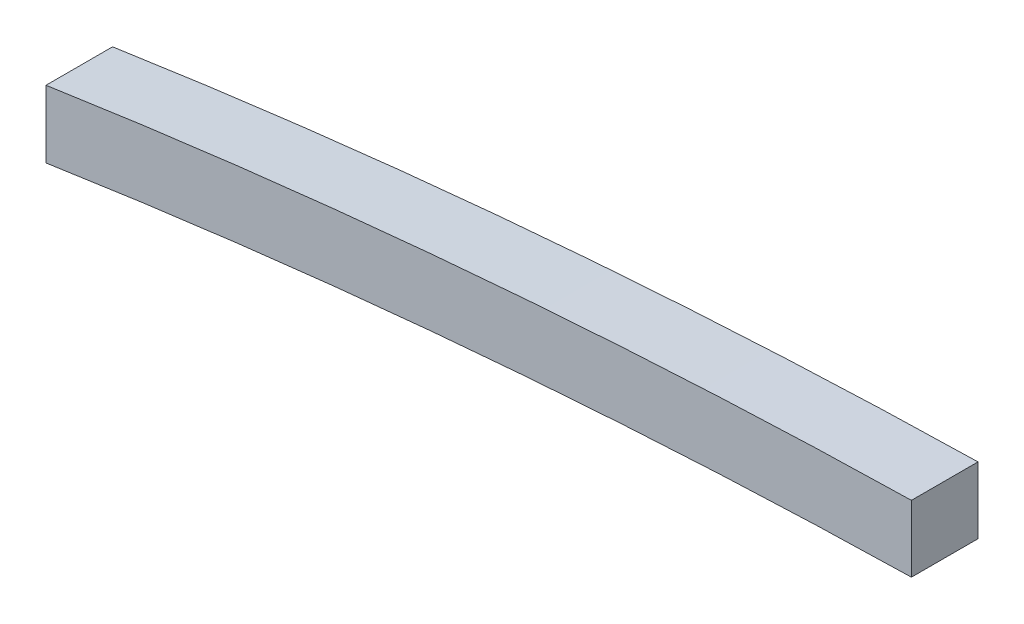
ISO-10303-21;
HEADER;
FILE_DESCRIPTION(('STEP AP214'),'2;1');
FILE_NAME('part.step','',(''),(''),'','','');
FILE_SCHEMA(('AUTOMOTIVE_DESIGN { 1 0 10303 214 1 1 1 1 }'));
ENDSEC;
DATA;
#1=APPLICATION_CONTEXT('core data for automotive mechanical design processes');
#2=APPLICATION_PROTOCOL_DEFINITION('international standard','automotive_design',2000,#1);
#3=PRODUCT_CONTEXT('',#1,'mechanical');
#4=PRODUCT('Part','Part','',(#3));
#5=PRODUCT_RELATED_PRODUCT_CATEGORY('part','',(#4));
#6=PRODUCT_DEFINITION_FORMATION('','',#4);
#7=PRODUCT_DEFINITION_CONTEXT('part definition',#1,'design');
#8=PRODUCT_DEFINITION('design','',#6,#7);
#9=PRODUCT_DEFINITION_SHAPE('','',#8);
#10=(LENGTH_UNIT() NAMED_UNIT(*) SI_UNIT(.MILLI.,.METRE.));
#11=(NAMED_UNIT(*) PLANE_ANGLE_UNIT() SI_UNIT($,.RADIAN.));
#12=(NAMED_UNIT(*) SI_UNIT($,.STERADIAN.) SOLID_ANGLE_UNIT());
#13=UNCERTAINTY_MEASURE_WITH_UNIT(LENGTH_MEASURE(1.E-05),#10,'distance_accuracy_value','');
#14=(GEOMETRIC_REPRESENTATION_CONTEXT(3) GLOBAL_UNCERTAINTY_ASSIGNED_CONTEXT((#13)) GLOBAL_UNIT_ASSIGNED_CONTEXT((#10,
#11,#12)) REPRESENTATION_CONTEXT('',''));
#15=CARTESIAN_POINT('',(0.,0.,0.));
#16=DIRECTION('',(0.,0.,1.));
#17=DIRECTION('',(1.,0.,0.));
#18=AXIS2_PLACEMENT_3D('',#15,#16,#17);
#19=CARTESIAN_POINT('',(650.,-1116.52349681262,-50.));
#20=DIRECTION('',(-1.,0.,0.));
#21=DIRECTION('',(0.,0.,1.));
#22=AXIS2_PLACEMENT_3D('',#19,#20,#21);
#23=PLANE('',#22);
#24=DIRECTION('',(0.,-1.,0.));
#25=VECTOR('',#24,1.);
#26=CARTESIAN_POINT('',(650.,-1116.52349681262,0.));
#27=LINE('',#26,#25);
#28=CARTESIAN_POINT('',(650.,105.579820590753,0.));
#29=VERTEX_POINT('',#28);
#30=CARTESIAN_POINT('',(650.,55.5699166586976,0.));
#31=VERTEX_POINT('',#30);
#32=EDGE_CURVE('E97',#29,#31,#27,.T.);
#33=ORIENTED_EDGE('',*,*,#32,.T.);
#34=DIRECTION('',(0.,0.,1.));
#35=VECTOR('',#34,1.);
#36=CARTESIAN_POINT('',(650.,55.5699166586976,-50.));
#37=LINE('',#36,#35);
#38=CARTESIAN_POINT('',(650.,55.5699166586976,-50.));
#39=VERTEX_POINT('',#38);
#40=EDGE_CURVE('E11',#39,#31,#37,.T.);
#41=ORIENTED_EDGE('',*,*,#40,.F.);
#42=DIRECTION('',(0.,-1.,0.));
#43=VECTOR('',#42,1.);
#44=CARTESIAN_POINT('',(650.,-1116.52349681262,-50.));
#45=LINE('',#44,#43);
#46=CARTESIAN_POINT('',(650.,105.579820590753,-50.));
#47=VERTEX_POINT('',#46);
#48=EDGE_CURVE('E92',#47,#39,#45,.T.);
#49=ORIENTED_EDGE('',*,*,#48,.F.);
#50=DIRECTION('',(0.,0.,1.));
#51=VECTOR('',#50,1.);
#52=CARTESIAN_POINT('',(650.,105.579820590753,-50.));
#53=LINE('',#52,#51);
#54=EDGE_CURVE('E36',#47,#29,#53,.T.);
#55=ORIENTED_EDGE('',*,*,#54,.T.);
#56=EDGE_LOOP('',(#33,#41,#49,#55));
#57=FACE_BOUND('',#56,.T.);
#58=ADVANCED_FACE('F33',(#57),#23,.F.);
#59=CARTESIAN_POINT('',(750.000000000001,-4943.4299833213,-50.));
#60=DIRECTION('',(0.,0.,1.));
#61=DIRECTION('',(1.,0.,0.));
#62=AXIS2_PLACEMENT_3D('',#59,#60,#61);
#63=CYLINDRICAL_SURFACE('',#62,5000.);
#64=CARTESIAN_POINT('',(750.000000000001,-4943.4299833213,0.));
#65=DIRECTION('',(0.,0.,1.));
#66=DIRECTION('',(1.,0.,0.));
#67=AXIS2_PLACEMENT_3D('',#64,#65,#66);
#68=CIRCLE('',#67,5000.);
#69=CARTESIAN_POINT('',(0.,0.,0.));
#70=VERTEX_POINT('',#69);
#71=EDGE_CURVE('E64',#31,#70,#68,.T.);
#72=ORIENTED_EDGE('',*,*,#71,.T.);
#73=DIRECTION('',(0.,0.,1.));
#74=VECTOR('',#73,1.);
#75=CARTESIAN_POINT('',(0.,0.,-50.));
#76=LINE('',#75,#74);
#77=CARTESIAN_POINT('',(0.,0.,-50.));
#78=VERTEX_POINT('',#77);
#79=EDGE_CURVE('E42',#78,#70,#76,.T.);
#80=ORIENTED_EDGE('',*,*,#79,.F.);
#81=CARTESIAN_POINT('',(750.000000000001,-4943.4299833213,-50.));
#82=DIRECTION('',(0.,0.,1.));
#83=DIRECTION('',(1.,0.,0.));
#84=AXIS2_PLACEMENT_3D('',#81,#82,#83);
#85=CIRCLE('',#84,5000.);
#86=EDGE_CURVE('E50',#39,#78,#85,.T.);
#87=ORIENTED_EDGE('',*,*,#86,.F.);
#88=ORIENTED_EDGE('',*,*,#40,.T.);
#89=EDGE_LOOP('',(#72,#80,#87,#88));
#90=FACE_BOUND('',#89,.T.);
#91=ADVANCED_FACE('F107',(#90),#63,.F.);
#92=CARTESIAN_POINT('',(0.,-1116.52349681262,-50.));
#93=DIRECTION('',(1.,0.,0.));
#94=DIRECTION('',(0.,0.,-1.));
#95=AXIS2_PLACEMENT_3D('',#92,#93,#94);
#96=PLANE('',#95);
#97=DIRECTION('',(0.,1.,0.));
#98=VECTOR('',#97,1.);
#99=CARTESIAN_POINT('',(0.,-1116.52349681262,0.));
#100=LINE('',#99,#98);
#101=CARTESIAN_POINT('',(0.,50.5664123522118,0.));
#102=VERTEX_POINT('',#101);
#103=EDGE_CURVE('E89',#70,#102,#100,.T.);
#104=ORIENTED_EDGE('',*,*,#103,.T.);
#105=DIRECTION('',(0.,0.,1.));
#106=VECTOR('',#105,1.);
#107=CARTESIAN_POINT('',(0.,50.5664123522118,-50.));
#108=LINE('',#107,#106);
#109=CARTESIAN_POINT('',(0.,50.5664123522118,-50.));
#110=VERTEX_POINT('',#109);
#111=EDGE_CURVE('E87',#110,#102,#108,.T.);
#112=ORIENTED_EDGE('',*,*,#111,.F.);
#113=DIRECTION('',(0.,1.,0.));
#114=VECTOR('',#113,1.);
#115=CARTESIAN_POINT('',(0.,-1116.52349681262,-50.));
#116=LINE('',#115,#114);
#117=EDGE_CURVE('E80',#78,#110,#116,.T.);
#118=ORIENTED_EDGE('',*,*,#117,.F.);
#119=ORIENTED_EDGE('',*,*,#79,.T.);
#120=EDGE_LOOP('',(#104,#112,#118,#119));
#121=FACE_BOUND('',#120,.T.);
#122=ADVANCED_FACE('F88',(#121),#96,.F.);
#123=CARTESIAN_POINT('',(750.000000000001,-4943.4299833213,-50.));
#124=DIRECTION('',(0.,0.,1.));
#125=DIRECTION('',(1.,0.,0.));
#126=AXIS2_PLACEMENT_3D('',#123,#124,#125);
#127=CYLINDRICAL_SURFACE('',#126,5050.);
#128=CARTESIAN_POINT('',(750.000000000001,-4943.4299833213,0.));
#129=DIRECTION('',(0.,0.,1.));
#130=DIRECTION('',(1.,0.,0.));
#131=AXIS2_PLACEMENT_3D('',#128,#129,#130);
#132=CIRCLE('',#131,5050.);
#133=EDGE_CURVE('E100',#29,#102,#132,.T.);
#134=ORIENTED_EDGE('',*,*,#133,.F.);
#135=ORIENTED_EDGE('',*,*,#54,.F.);
#136=CARTESIAN_POINT('',(750.000000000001,-4943.4299833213,-50.));
#137=DIRECTION('',(0.,0.,1.));
#138=DIRECTION('',(1.,0.,0.));
#139=AXIS2_PLACEMENT_3D('',#136,#137,#138);
#140=CIRCLE('',#139,5050.);
#141=EDGE_CURVE('E83',#47,#110,#140,.T.);
#142=ORIENTED_EDGE('',*,*,#141,.T.);
#143=ORIENTED_EDGE('',*,*,#111,.T.);
#144=EDGE_LOOP('',(#134,#135,#142,#143));
#145=FACE_BOUND('',#144,.T.);
#146=ADVANCED_FACE('F91',(#145),#127,.T.);
#147=CARTESIAN_POINT('',(750.,-1116.52349681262,-50.));
#148=DIRECTION('',(0.,0.,1.));
#149=DIRECTION('',(1.,0.,0.));
#150=AXIS2_PLACEMENT_3D('',#147,#148,#149);
#151=PLANE('',#150);
#152=ORIENTED_EDGE('',*,*,#48,.T.);
#153=ORIENTED_EDGE('',*,*,#86,.T.);
#154=ORIENTED_EDGE('',*,*,#117,.T.);
#155=ORIENTED_EDGE('',*,*,#141,.F.);
#156=EDGE_LOOP('',(#152,#153,#154,#155));
#157=FACE_BOUND('',#156,.T.);
#158=ADVANCED_FACE('F82',(#157),#151,.F.);
#159=CARTESIAN_POINT('',(750.,-1116.52349681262,0.));
#160=DIRECTION('',(0.,0.,1.));
#161=DIRECTION('',(1.,0.,0.));
#162=AXIS2_PLACEMENT_3D('',#159,#160,#161);
#163=PLANE('',#162);
#164=ORIENTED_EDGE('',*,*,#32,.F.);
#165=ORIENTED_EDGE('',*,*,#133,.T.);
#166=ORIENTED_EDGE('',*,*,#103,.F.);
#167=ORIENTED_EDGE('',*,*,#71,.F.);
#168=EDGE_LOOP('',(#164,#165,#166,#167));
#169=FACE_BOUND('',#168,.T.);
#170=ADVANCED_FACE('F104',(#169),#163,.T.);
#171=CLOSED_SHELL('',(#58,#91,#122,#146,#158,#170));
#172=MANIFOLD_SOLID_BREP('B2',#171);
#173=ADVANCED_BREP_SHAPE_REPRESENTATION('',(#18,#172),#14);
#174=SHAPE_DEFINITION_REPRESENTATION(#9,#173);
ENDSEC;
END-ISO-10303-21;
